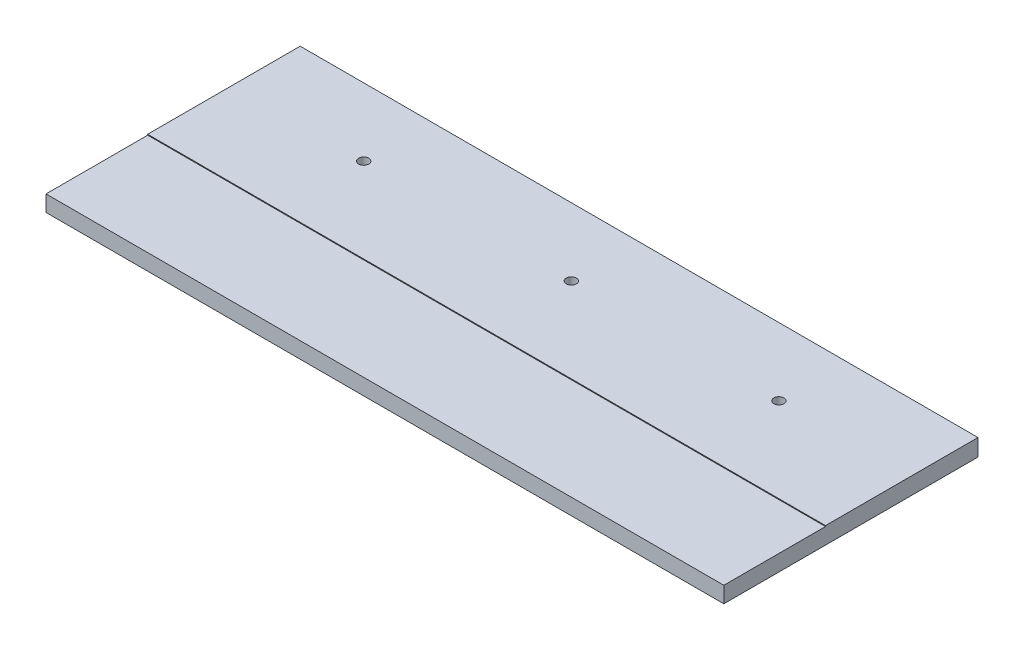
ISO-10303-21;
HEADER;
FILE_DESCRIPTION(('STEP AP214'),'2;1');
FILE_NAME('part.step','',(''),(''),'','','');
FILE_SCHEMA(('AUTOMOTIVE_DESIGN { 1 0 10303 214 1 1 1 1 }'));
ENDSEC;
DATA;
#1=APPLICATION_CONTEXT('core data for automotive mechanical design processes');
#2=APPLICATION_PROTOCOL_DEFINITION('international standard','automotive_design',2000,#1);
#3=PRODUCT_CONTEXT('',#1,'mechanical');
#4=PRODUCT('Part','Part','',(#3));
#5=PRODUCT_RELATED_PRODUCT_CATEGORY('part','',(#4));
#6=PRODUCT_DEFINITION_FORMATION('','',#4);
#7=PRODUCT_DEFINITION_CONTEXT('part definition',#1,'design');
#8=PRODUCT_DEFINITION('design','',#6,#7);
#9=PRODUCT_DEFINITION_SHAPE('','',#8);
#10=(LENGTH_UNIT() NAMED_UNIT(*) SI_UNIT(.MILLI.,.METRE.));
#11=(NAMED_UNIT(*) PLANE_ANGLE_UNIT() SI_UNIT($,.RADIAN.));
#12=(NAMED_UNIT(*) SI_UNIT($,.STERADIAN.) SOLID_ANGLE_UNIT());
#13=UNCERTAINTY_MEASURE_WITH_UNIT(LENGTH_MEASURE(1.E-05),#10,'distance_accuracy_value','');
#14=(GEOMETRIC_REPRESENTATION_CONTEXT(3) GLOBAL_UNCERTAINTY_ASSIGNED_CONTEXT((#13)) GLOBAL_UNIT_ASSIGNED_CONTEXT((#10,
#11,#12)) REPRESENTATION_CONTEXT('',''));
#15=CARTESIAN_POINT('',(0.,0.,0.));
#16=DIRECTION('',(0.,0.,1.));
#17=DIRECTION('',(1.,0.,0.));
#18=AXIS2_PLACEMENT_3D('',#15,#16,#17);
#19=CARTESIAN_POINT('',(-400.,20.,150.));
#20=DIRECTION('',(0.,0.,-1.));
#21=DIRECTION('',(-1.,0.,0.));
#22=AXIS2_PLACEMENT_3D('',#19,#20,#21);
#23=PLANE('',#22);
#24=DIRECTION('',(1.,0.,0.));
#25=VECTOR('',#24,1.);
#26=CARTESIAN_POINT('',(400.,19.,150.));
#27=LINE('',#26,#25);
#28=CARTESIAN_POINT('',(-400.,19.,150.));
#29=VERTEX_POINT('',#28);
#30=CARTESIAN_POINT('',(400.,19.,150.));
#31=VERTEX_POINT('',#30);
#32=EDGE_CURVE('E41',#29,#31,#27,.T.);
#33=ORIENTED_EDGE('',*,*,#32,.F.);
#34=DIRECTION('',(0.,-1.,0.));
#35=VECTOR('',#34,1.);
#36=CARTESIAN_POINT('',(-400.,20.,150.));
#37=LINE('',#36,#35);
#38=CARTESIAN_POINT('',(-400.,0.,150.));
#39=VERTEX_POINT('',#38);
#40=EDGE_CURVE('E11',#29,#39,#37,.T.);
#41=ORIENTED_EDGE('',*,*,#40,.T.);
#42=DIRECTION('',(1.,0.,0.));
#43=VECTOR('',#42,1.);
#44=CARTESIAN_POINT('',(-400.,0.,150.));
#45=LINE('',#44,#43);
#46=CARTESIAN_POINT('',(400.,0.,150.));
#47=VERTEX_POINT('',#46);
#48=EDGE_CURVE('E116',#39,#47,#45,.T.);
#49=ORIENTED_EDGE('',*,*,#48,.T.);
#50=DIRECTION('',(0.,-1.,0.));
#51=VECTOR('',#50,1.);
#52=CARTESIAN_POINT('',(400.,20.,150.));
#53=LINE('',#52,#51);
#54=EDGE_CURVE('E34',#31,#47,#53,.T.);
#55=ORIENTED_EDGE('',*,*,#54,.F.);
#56=EDGE_LOOP('',(#33,#41,#49,#55));
#57=FACE_BOUND('',#56,.T.);
#58=ADVANCED_FACE('F26',(#57),#23,.F.);
#59=CARTESIAN_POINT('',(-400.,20.,150.));
#60=DIRECTION('',(0.,1.,0.));
#61=DIRECTION('',(0.,0.,1.));
#62=AXIS2_PLACEMENT_3D('',#59,#60,#61);
#63=PLANE('',#62);
#64=DIRECTION('',(-1.,0.,0.));
#65=VECTOR('',#64,1.);
#66=CARTESIAN_POINT('',(400.,20.,30.));
#67=LINE('',#66,#65);
#68=CARTESIAN_POINT('',(400.,20.,30.));
#69=VERTEX_POINT('',#68);
#70=CARTESIAN_POINT('',(-400.,20.,30.));
#71=VERTEX_POINT('',#70);
#72=EDGE_CURVE('E82',#69,#71,#67,.T.);
#73=ORIENTED_EDGE('',*,*,#72,.F.);
#74=DIRECTION('',(0.,0.,-1.));
#75=VECTOR('',#74,1.);
#76=CARTESIAN_POINT('',(400.,20.,-150.));
#77=LINE('',#76,#75);
#78=CARTESIAN_POINT('',(400.,20.,-150.));
#79=VERTEX_POINT('',#78);
#80=EDGE_CURVE('E92',#69,#79,#77,.T.);
#81=ORIENTED_EDGE('',*,*,#80,.T.);
#82=DIRECTION('',(-1.,0.,0.));
#83=VECTOR('',#82,1.);
#84=CARTESIAN_POINT('',(-400.,20.,-150.));
#85=LINE('',#84,#83);
#86=CARTESIAN_POINT('',(-400.,20.,-150.));
#87=VERTEX_POINT('',#86);
#88=EDGE_CURVE('E49',#79,#87,#85,.T.);
#89=ORIENTED_EDGE('',*,*,#88,.T.);
#90=DIRECTION('',(0.,0.,1.));
#91=VECTOR('',#90,1.);
#92=CARTESIAN_POINT('',(-400.,20.,-150.));
#93=LINE('',#92,#91);
#94=EDGE_CURVE('E95',#87,#71,#93,.T.);
#95=ORIENTED_EDGE('',*,*,#94,.T.);
#96=EDGE_LOOP('',(#73,#81,#89,#95));
#97=FACE_BOUND('',#96,.T.);
#98=CARTESIAN_POINT('',(245.,20.,-70.));
#99=DIRECTION('',(0.,1.,0.));
#100=DIRECTION('',(0.,0.,1.));
#101=AXIS2_PLACEMENT_3D('',#98,#99,#100);
#102=CIRCLE('',#101,5.99999999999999);
#103=CARTESIAN_POINT('',(245.,20.,-64.));
#104=VERTEX_POINT('',#103);
#105=EDGE_CURVE('E135',#104,#104,#102,.T.);
#106=ORIENTED_EDGE('',*,*,#105,.F.);
#107=EDGE_LOOP('',(#106));
#108=FACE_BOUND('',#107,.T.);
#109=CARTESIAN_POINT('',(0.,20.,-70.));
#110=DIRECTION('',(0.,1.,0.));
#111=DIRECTION('',(0.,0.,1.));
#112=AXIS2_PLACEMENT_3D('',#109,#110,#111);
#113=CIRCLE('',#112,6.);
#114=CARTESIAN_POINT('',(0.,20.,-63.9999999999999));
#115=VERTEX_POINT('',#114);
#116=EDGE_CURVE('E129',#115,#115,#113,.T.);
#117=ORIENTED_EDGE('',*,*,#116,.F.);
#118=EDGE_LOOP('',(#117));
#119=FACE_BOUND('',#118,.T.);
#120=CARTESIAN_POINT('',(-245.,20.,-70.));
#121=DIRECTION('',(0.,1.,0.));
#122=DIRECTION('',(0.,0.,-1.));
#123=AXIS2_PLACEMENT_3D('',#120,#121,#122);
#124=CIRCLE('',#123,5.99999999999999);
#125=CARTESIAN_POINT('',(-245.,20.,-76.));
#126=VERTEX_POINT('',#125);
#127=EDGE_CURVE('E141',#126,#126,#124,.T.);
#128=ORIENTED_EDGE('',*,*,#127,.F.);
#129=EDGE_LOOP('',(#128));
#130=FACE_BOUND('',#129,.T.);
#131=ADVANCED_FACE('F90',(#97,#108,#119,#130),#63,.T.);
#132=CARTESIAN_POINT('',(-400.,0.,150.));
#133=DIRECTION('',(0.,1.,0.));
#134=DIRECTION('',(0.,0.,1.));
#135=AXIS2_PLACEMENT_3D('',#132,#133,#134);
#136=PLANE('',#135);
#137=CARTESIAN_POINT('',(245.,0.,-70.));
#138=DIRECTION('',(0.,1.,0.));
#139=DIRECTION('',(0.,0.,1.));
#140=AXIS2_PLACEMENT_3D('',#137,#138,#139);
#141=CIRCLE('',#140,5.99999999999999);
#142=CARTESIAN_POINT('',(245.,0.,-64.));
#143=VERTEX_POINT('',#142);
#144=EDGE_CURVE('E138',#143,#143,#141,.T.);
#145=ORIENTED_EDGE('',*,*,#144,.T.);
#146=EDGE_LOOP('',(#145));
#147=FACE_BOUND('',#146,.T.);
#148=DIRECTION('',(0.,0.,1.));
#149=VECTOR('',#148,1.);
#150=CARTESIAN_POINT('',(-400.,0.,-150.));
#151=LINE('',#150,#149);
#152=CARTESIAN_POINT('',(-400.,0.,-150.));
#153=VERTEX_POINT('',#152);
#154=EDGE_CURVE('E121',#153,#39,#151,.T.);
#155=ORIENTED_EDGE('',*,*,#154,.F.);
#156=DIRECTION('',(-1.,0.,0.));
#157=VECTOR('',#156,1.);
#158=CARTESIAN_POINT('',(-400.,0.,-150.));
#159=LINE('',#158,#157);
#160=CARTESIAN_POINT('',(400.,0.,-150.));
#161=VERTEX_POINT('',#160);
#162=EDGE_CURVE('E104',#161,#153,#159,.T.);
#163=ORIENTED_EDGE('',*,*,#162,.F.);
#164=DIRECTION('',(0.,0.,-1.));
#165=VECTOR('',#164,1.);
#166=CARTESIAN_POINT('',(400.,0.,-150.));
#167=LINE('',#166,#165);
#168=EDGE_CURVE('E113',#47,#161,#167,.T.);
#169=ORIENTED_EDGE('',*,*,#168,.F.);
#170=ORIENTED_EDGE('',*,*,#48,.F.);
#171=EDGE_LOOP('',(#155,#163,#169,#170));
#172=FACE_BOUND('',#171,.T.);
#173=CARTESIAN_POINT('',(0.,0.,-70.));
#174=DIRECTION('',(0.,1.,0.));
#175=DIRECTION('',(0.,0.,1.));
#176=AXIS2_PLACEMENT_3D('',#173,#174,#175);
#177=CIRCLE('',#176,6.);
#178=CARTESIAN_POINT('',(0.,0.,-63.9999999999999));
#179=VERTEX_POINT('',#178);
#180=EDGE_CURVE('E132',#179,#179,#177,.T.);
#181=ORIENTED_EDGE('',*,*,#180,.T.);
#182=EDGE_LOOP('',(#181));
#183=FACE_BOUND('',#182,.T.);
#184=CARTESIAN_POINT('',(-245.,0.,-70.));
#185=DIRECTION('',(0.,1.,0.));
#186=DIRECTION('',(0.,0.,-1.));
#187=AXIS2_PLACEMENT_3D('',#184,#185,#186);
#188=CIRCLE('',#187,5.99999999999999);
#189=CARTESIAN_POINT('',(-245.,0.,-76.));
#190=VERTEX_POINT('',#189);
#191=EDGE_CURVE('E144',#190,#190,#188,.T.);
#192=ORIENTED_EDGE('',*,*,#191,.T.);
#193=EDGE_LOOP('',(#192));
#194=FACE_BOUND('',#193,.T.);
#195=ADVANCED_FACE('F124',(#147,#172,#183,#194),#136,.F.);
#196=CARTESIAN_POINT('',(-400.,20.,-150.));
#197=DIRECTION('',(1.,0.,0.));
#198=DIRECTION('',(0.,0.,-1.));
#199=AXIS2_PLACEMENT_3D('',#196,#197,#198);
#200=PLANE('',#199);
#201=DIRECTION('',(0.,0.,1.));
#202=VECTOR('',#201,1.);
#203=CARTESIAN_POINT('',(-400.,19.,150.));
#204=LINE('',#203,#202);
#205=CARTESIAN_POINT('',(-400.,19.,30.));
#206=VERTEX_POINT('',#205);
#207=EDGE_CURVE('E149',#206,#29,#204,.T.);
#208=ORIENTED_EDGE('',*,*,#207,.F.);
#209=DIRECTION('',(0.,1.,0.));
#210=VECTOR('',#209,1.);
#211=CARTESIAN_POINT('',(-400.,19.,30.));
#212=LINE('',#211,#210);
#213=EDGE_CURVE('E88',#206,#71,#212,.T.);
#214=ORIENTED_EDGE('',*,*,#213,.T.);
#215=ORIENTED_EDGE('',*,*,#94,.F.);
#216=DIRECTION('',(0.,-1.,0.));
#217=VECTOR('',#216,1.);
#218=CARTESIAN_POINT('',(-400.,20.,-150.));
#219=LINE('',#218,#217);
#220=EDGE_CURVE('E102',#87,#153,#219,.T.);
#221=ORIENTED_EDGE('',*,*,#220,.T.);
#222=ORIENTED_EDGE('',*,*,#154,.T.);
#223=ORIENTED_EDGE('',*,*,#40,.F.);
#224=EDGE_LOOP('',(#208,#214,#215,#221,#222,#223));
#225=FACE_BOUND('',#224,.T.);
#226=ADVANCED_FACE('F28',(#225),#200,.F.);
#227=CARTESIAN_POINT('',(400.,20.,-150.));
#228=DIRECTION('',(-1.,0.,0.));
#229=DIRECTION('',(0.,0.,1.));
#230=AXIS2_PLACEMENT_3D('',#227,#228,#229);
#231=PLANE('',#230);
#232=ORIENTED_EDGE('',*,*,#80,.F.);
#233=DIRECTION('',(0.,1.,0.));
#234=VECTOR('',#233,1.);
#235=CARTESIAN_POINT('',(400.,19.,30.));
#236=LINE('',#235,#234);
#237=CARTESIAN_POINT('',(400.,19.,30.));
#238=VERTEX_POINT('',#237);
#239=EDGE_CURVE('E79',#238,#69,#236,.T.);
#240=ORIENTED_EDGE('',*,*,#239,.F.);
#241=DIRECTION('',(0.,0.,-1.));
#242=VECTOR('',#241,1.);
#243=CARTESIAN_POINT('',(400.,19.,150.));
#244=LINE('',#243,#242);
#245=EDGE_CURVE('E96',#31,#238,#244,.T.);
#246=ORIENTED_EDGE('',*,*,#245,.F.);
#247=ORIENTED_EDGE('',*,*,#54,.T.);
#248=ORIENTED_EDGE('',*,*,#168,.T.);
#249=DIRECTION('',(0.,-1.,0.));
#250=VECTOR('',#249,1.);
#251=CARTESIAN_POINT('',(400.,20.,-150.));
#252=LINE('',#251,#250);
#253=EDGE_CURVE('E100',#79,#161,#252,.T.);
#254=ORIENTED_EDGE('',*,*,#253,.F.);
#255=EDGE_LOOP('',(#232,#240,#246,#247,#248,#254));
#256=FACE_BOUND('',#255,.T.);
#257=ADVANCED_FACE('F98',(#256),#231,.F.);
#258=CARTESIAN_POINT('',(-400.,20.,-150.));
#259=DIRECTION('',(0.,0.,1.));
#260=DIRECTION('',(1.,0.,0.));
#261=AXIS2_PLACEMENT_3D('',#258,#259,#260);
#262=PLANE('',#261);
#263=ORIENTED_EDGE('',*,*,#162,.T.);
#264=ORIENTED_EDGE('',*,*,#220,.F.);
#265=ORIENTED_EDGE('',*,*,#88,.F.);
#266=ORIENTED_EDGE('',*,*,#253,.T.);
#267=EDGE_LOOP('',(#263,#264,#265,#266));
#268=FACE_BOUND('',#267,.T.);
#269=ADVANCED_FACE('F156',(#268),#262,.F.);
#270=CARTESIAN_POINT('',(0.,20.,-70.));
#271=DIRECTION('',(0.,-1.,0.));
#272=DIRECTION('',(0.,0.,-1.));
#273=AXIS2_PLACEMENT_3D('',#270,#271,#272);
#274=CYLINDRICAL_SURFACE('',#273,6.);
#275=ORIENTED_EDGE('',*,*,#116,.T.);
#276=EDGE_LOOP('',(#275));
#277=FACE_BOUND('',#276,.T.);
#278=ORIENTED_EDGE('',*,*,#180,.F.);
#279=EDGE_LOOP('',(#278));
#280=FACE_BOUND('',#279,.T.);
#281=ADVANCED_FACE('F158',(#277,#280),#274,.F.);
#282=CARTESIAN_POINT('',(245.,20.,-70.));
#283=DIRECTION('',(0.,-1.,0.));
#284=DIRECTION('',(0.,0.,-1.));
#285=AXIS2_PLACEMENT_3D('',#282,#283,#284);
#286=CYLINDRICAL_SURFACE('',#285,5.99999999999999);
#287=ORIENTED_EDGE('',*,*,#105,.T.);
#288=EDGE_LOOP('',(#287));
#289=FACE_BOUND('',#288,.T.);
#290=ORIENTED_EDGE('',*,*,#144,.F.);
#291=EDGE_LOOP('',(#290));
#292=FACE_BOUND('',#291,.T.);
#293=ADVANCED_FACE('F164',(#289,#292),#286,.F.);
#294=CARTESIAN_POINT('',(-245.,20.,-70.));
#295=DIRECTION('',(0.,-1.,0.));
#296=DIRECTION('',(0.,0.,-1.));
#297=AXIS2_PLACEMENT_3D('',#294,#295,#296);
#298=CYLINDRICAL_SURFACE('',#297,5.99999999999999);
#299=ORIENTED_EDGE('',*,*,#127,.T.);
#300=EDGE_LOOP('',(#299));
#301=FACE_BOUND('',#300,.T.);
#302=ORIENTED_EDGE('',*,*,#191,.F.);
#303=EDGE_LOOP('',(#302));
#304=FACE_BOUND('',#303,.T.);
#305=ADVANCED_FACE('F183',(#301,#304),#298,.F.);
#306=CARTESIAN_POINT('',(400.,19.,30.));
#307=DIRECTION('',(0.,0.,-1.));
#308=DIRECTION('',(-1.,0.,0.));
#309=AXIS2_PLACEMENT_3D('',#306,#307,#308);
#310=PLANE('',#309);
#311=ORIENTED_EDGE('',*,*,#72,.T.);
#312=ORIENTED_EDGE('',*,*,#213,.F.);
#313=DIRECTION('',(-1.,0.,0.));
#314=VECTOR('',#313,1.);
#315=CARTESIAN_POINT('',(400.,19.,30.));
#316=LINE('',#315,#314);
#317=EDGE_CURVE('E85',#238,#206,#316,.T.);
#318=ORIENTED_EDGE('',*,*,#317,.F.);
#319=ORIENTED_EDGE('',*,*,#239,.T.);
#320=EDGE_LOOP('',(#311,#312,#318,#319));
#321=FACE_BOUND('',#320,.T.);
#322=ADVANCED_FACE('F81',(#321),#310,.F.);
#323=CARTESIAN_POINT('',(400.,19.,30.));
#324=DIRECTION('',(0.,1.,0.));
#325=DIRECTION('',(0.,0.,1.));
#326=AXIS2_PLACEMENT_3D('',#323,#324,#325);
#327=PLANE('',#326);
#328=ORIENTED_EDGE('',*,*,#245,.T.);
#329=ORIENTED_EDGE('',*,*,#317,.T.);
#330=ORIENTED_EDGE('',*,*,#207,.T.);
#331=ORIENTED_EDGE('',*,*,#32,.T.);
#332=EDGE_LOOP('',(#328,#329,#330,#331));
#333=FACE_BOUND('',#332,.T.);
#334=ADVANCED_FACE('F152',(#333),#327,.T.);
#335=CLOSED_SHELL('',(#58,#131,#195,#226,#257,#269,#281,#293,#305,#322,#334));
#336=MANIFOLD_SOLID_BREP('B2',#335);
#337=ADVANCED_BREP_SHAPE_REPRESENTATION('',(#18,#336),#14);
#338=SHAPE_DEFINITION_REPRESENTATION(#9,#337);
ENDSEC;
END-ISO-10303-21;
